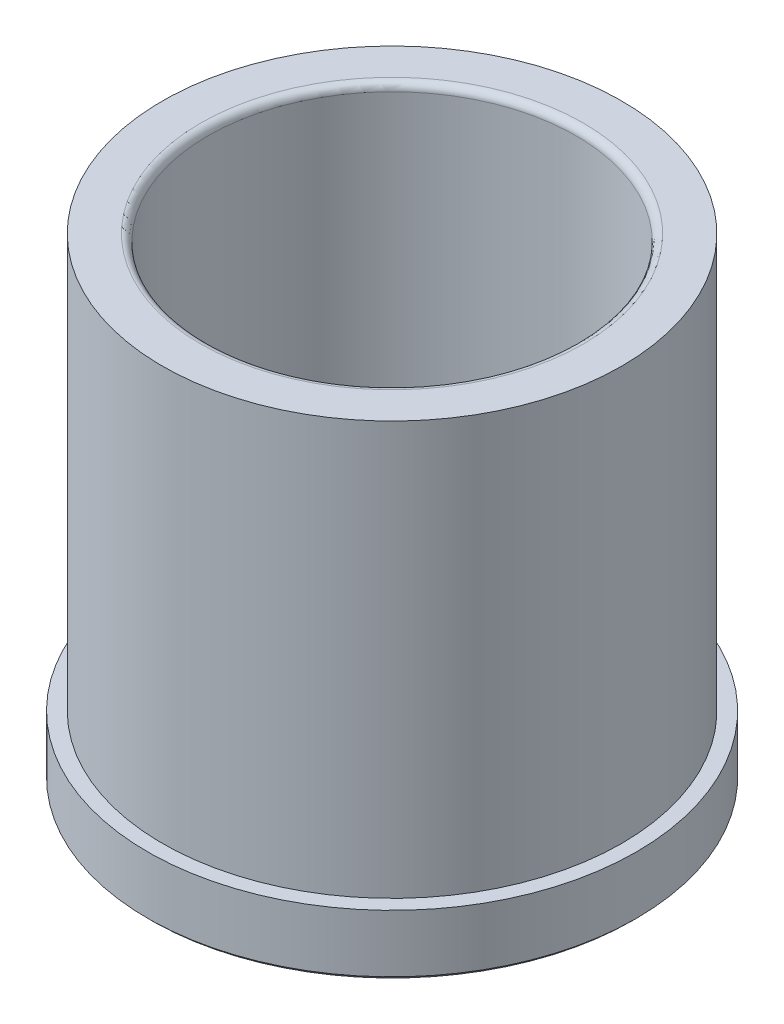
from build123d import *

# Parameters (mm, degrees)
FILLET1_R = 1.524


with BuildPart() as part:
    # Sketch1 → Revolve1 (revolve)
    with BuildSketch(Plane.XY, mode=Mode.PRIVATE) as revolve1_sk:
        Polygon((-49.911, 0), (-50.673, 0.762), (-50.673, 12.7), (-47.63135, 12.7), (-47.63135, 98.425), (-38.1635, 98.425), (-38.1635, 0.762), (-38.9255, 0), align=None)
    revolve(revolve1_sk.sketch.rotate(Axis((0, -1000, 0), (0, 1, 0)), 180), axis=Axis((0, -1000, 0), (0, 1, 0)))

    # Fillet1
    fillet1_edges = [part.edges().sort_by_distance(p)[0] for p in [
        (-38.1635, 98.425, 0),
    ]]
    fillet(fillet1_edges, radius=FILLET1_R)


solid = part.part
